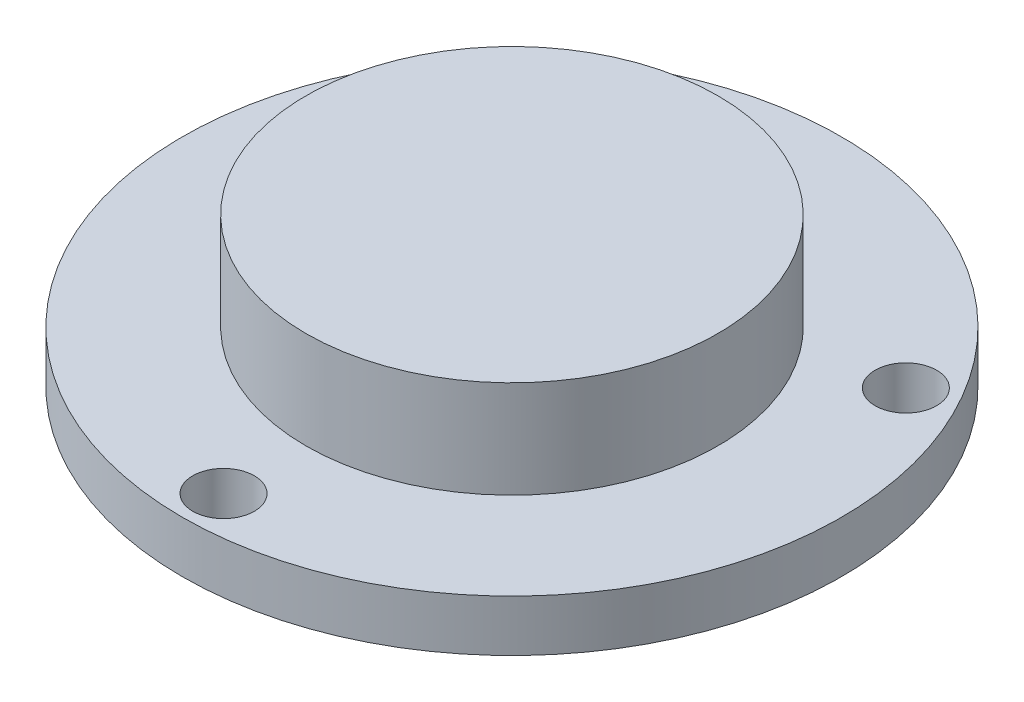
ISO-10303-21;
HEADER;
FILE_DESCRIPTION(('STEP AP214'),'2;1');
FILE_NAME('part.step','',(''),(''),'','','');
FILE_SCHEMA(('AUTOMOTIVE_DESIGN { 1 0 10303 214 1 1 1 1 }'));
ENDSEC;
DATA;
#1=APPLICATION_CONTEXT('core data for automotive mechanical design processes');
#2=APPLICATION_PROTOCOL_DEFINITION('international standard','automotive_design',2000,#1);
#3=PRODUCT_CONTEXT('',#1,'mechanical');
#4=PRODUCT('Part','Part','',(#3));
#5=PRODUCT_RELATED_PRODUCT_CATEGORY('part','',(#4));
#6=PRODUCT_DEFINITION_FORMATION('','',#4);
#7=PRODUCT_DEFINITION_CONTEXT('part definition',#1,'design');
#8=PRODUCT_DEFINITION('design','',#6,#7);
#9=PRODUCT_DEFINITION_SHAPE('','',#8);
#10=(LENGTH_UNIT() NAMED_UNIT(*) SI_UNIT(.MILLI.,.METRE.));
#11=(NAMED_UNIT(*) PLANE_ANGLE_UNIT() SI_UNIT($,.RADIAN.));
#12=(NAMED_UNIT(*) SI_UNIT($,.STERADIAN.) SOLID_ANGLE_UNIT());
#13=UNCERTAINTY_MEASURE_WITH_UNIT(LENGTH_MEASURE(1.E-05),#10,'distance_accuracy_value','');
#14=(GEOMETRIC_REPRESENTATION_CONTEXT(3) GLOBAL_UNCERTAINTY_ASSIGNED_CONTEXT((#13)) GLOBAL_UNIT_ASSIGNED_CONTEXT((#10,
#11,#12)) REPRESENTATION_CONTEXT('',''));
#15=CARTESIAN_POINT('',(0.,0.,0.));
#16=DIRECTION('',(0.,0.,1.));
#17=DIRECTION('',(1.,0.,0.));
#18=AXIS2_PLACEMENT_3D('',#15,#16,#17);
#19=CARTESIAN_POINT('',(0.,3.175,0.));
#20=DIRECTION('',(0.,1.,0.));
#21=DIRECTION('',(0.,0.,1.));
#22=AXIS2_PLACEMENT_3D('',#19,#20,#21);
#23=PLANE('',#22);
#24=CARTESIAN_POINT('',(15.3979316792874,3.175,-8.88999999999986));
#25=DIRECTION('',(0.,1.,0.));
#26=DIRECTION('',(0.,0.,1.));
#27=AXIS2_PLACEMENT_3D('',#24,#25,#26);
#28=CIRCLE('',#27,1.89864999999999);
#29=CARTESIAN_POINT('',(15.3979316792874,3.175,-6.99134999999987));
#30=VERTEX_POINT('',#29);
#31=EDGE_CURVE('E66',#30,#30,#28,.T.);
#32=ORIENTED_EDGE('',*,*,#31,.F.);
#33=EDGE_LOOP('',(#32));
#34=FACE_BOUND('',#33,.T.);
#35=CARTESIAN_POINT('',(-15.3979316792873,3.175,-8.89000000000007));
#36=DIRECTION('',(0.,1.,0.));
#37=DIRECTION('',(0.,0.,1.));
#38=AXIS2_PLACEMENT_3D('',#35,#36,#37);
#39=CIRCLE('',#38,1.89864999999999);
#40=CARTESIAN_POINT('',(-15.3979316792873,3.175,-6.99135000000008));
#41=VERTEX_POINT('',#40);
#42=EDGE_CURVE('E60',#41,#41,#39,.T.);
#43=ORIENTED_EDGE('',*,*,#42,.F.);
#44=EDGE_LOOP('',(#43));
#45=FACE_BOUND('',#44,.T.);
#46=CARTESIAN_POINT('',(0.,3.175,17.78));
#47=DIRECTION('',(0.,1.,0.));
#48=DIRECTION('',(0.,0.,1.));
#49=AXIS2_PLACEMENT_3D('',#46,#47,#48);
#50=CIRCLE('',#49,1.89864999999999);
#51=CARTESIAN_POINT('',(0.,3.175,19.67865));
#52=VERTEX_POINT('',#51);
#53=EDGE_CURVE('E54',#52,#52,#50,.T.);
#54=ORIENTED_EDGE('',*,*,#53,.F.);
#55=EDGE_LOOP('',(#54));
#56=FACE_BOUND('',#55,.T.);
#57=CARTESIAN_POINT('',(0.,3.175,0.));
#58=DIRECTION('',(0.,1.,0.));
#59=DIRECTION('',(0.,0.,1.));
#60=AXIS2_PLACEMENT_3D('',#57,#58,#59);
#61=CIRCLE('',#60,20.32);
#62=CARTESIAN_POINT('',(0.,3.175,20.32));
#63=VERTEX_POINT('',#62);
#64=EDGE_CURVE('E10',#63,#63,#61,.T.);
#65=ORIENTED_EDGE('',*,*,#64,.T.);
#66=EDGE_LOOP('',(#65));
#67=FACE_BOUND('',#66,.T.);
#68=CARTESIAN_POINT('',(0.,3.175,0.));
#69=DIRECTION('',(0.,1.,0.));
#70=DIRECTION('',(0.,0.,1.));
#71=AXIS2_PLACEMENT_3D('',#68,#69,#70);
#72=CIRCLE('',#71,12.7);
#73=CARTESIAN_POINT('',(0.,3.175,12.7));
#74=VERTEX_POINT('',#73);
#75=EDGE_CURVE('E46',#74,#74,#72,.T.);
#76=ORIENTED_EDGE('',*,*,#75,.F.);
#77=EDGE_LOOP('',(#76));
#78=FACE_BOUND('',#77,.T.);
#79=ADVANCED_FACE('F33',(#34,#45,#56,#67,#78),#23,.T.);
#80=CARTESIAN_POINT('',(0.,3.175,0.));
#81=DIRECTION('',(0.,-1.,0.));
#82=DIRECTION('',(0.,0.,-1.));
#83=AXIS2_PLACEMENT_3D('',#80,#81,#82);
#84=CYLINDRICAL_SURFACE('',#83,20.32);
#85=ORIENTED_EDGE('',*,*,#64,.F.);
#86=EDGE_LOOP('',(#85));
#87=FACE_BOUND('',#86,.T.);
#88=CARTESIAN_POINT('',(0.,0.,0.));
#89=DIRECTION('',(0.,1.,0.));
#90=DIRECTION('',(0.,0.,1.));
#91=AXIS2_PLACEMENT_3D('',#88,#89,#90);
#92=CIRCLE('',#91,20.32);
#93=CARTESIAN_POINT('',(0.,0.,20.32));
#94=VERTEX_POINT('',#93);
#95=EDGE_CURVE('E37',#94,#94,#92,.T.);
#96=ORIENTED_EDGE('',*,*,#95,.T.);
#97=EDGE_LOOP('',(#96));
#98=FACE_BOUND('',#97,.T.);
#99=ADVANCED_FACE('F35',(#87,#98),#84,.T.);
#100=CARTESIAN_POINT('',(0.,0.,0.));
#101=DIRECTION('',(0.,1.,0.));
#102=DIRECTION('',(0.,0.,1.));
#103=AXIS2_PLACEMENT_3D('',#100,#101,#102);
#104=PLANE('',#103);
#105=CARTESIAN_POINT('',(15.3979316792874,0.,-8.88999999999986));
#106=DIRECTION('',(0.,1.,0.));
#107=DIRECTION('',(0.,0.,1.));
#108=AXIS2_PLACEMENT_3D('',#105,#106,#107);
#109=CIRCLE('',#108,1.89865);
#110=CARTESIAN_POINT('',(15.3979316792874,0.,-6.99134999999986));
#111=VERTEX_POINT('',#110);
#112=EDGE_CURVE('E63',#111,#111,#109,.T.);
#113=ORIENTED_EDGE('',*,*,#112,.T.);
#114=EDGE_LOOP('',(#113));
#115=FACE_BOUND('',#114,.T.);
#116=CARTESIAN_POINT('',(-15.3979316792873,0.,-8.89000000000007));
#117=DIRECTION('',(0.,1.,0.));
#118=DIRECTION('',(0.,0.,1.));
#119=AXIS2_PLACEMENT_3D('',#116,#117,#118);
#120=CIRCLE('',#119,1.89865);
#121=CARTESIAN_POINT('',(-15.3979316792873,0.,-6.99135000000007));
#122=VERTEX_POINT('',#121);
#123=EDGE_CURVE('E57',#122,#122,#120,.T.);
#124=ORIENTED_EDGE('',*,*,#123,.T.);
#125=EDGE_LOOP('',(#124));
#126=FACE_BOUND('',#125,.T.);
#127=CARTESIAN_POINT('',(0.,0.,17.78));
#128=DIRECTION('',(0.,1.,0.));
#129=DIRECTION('',(0.,0.,1.));
#130=AXIS2_PLACEMENT_3D('',#127,#128,#129);
#131=CIRCLE('',#130,1.89865);
#132=CARTESIAN_POINT('',(0.,0.,19.67865));
#133=VERTEX_POINT('',#132);
#134=EDGE_CURVE('E49',#133,#133,#131,.T.);
#135=ORIENTED_EDGE('',*,*,#134,.T.);
#136=EDGE_LOOP('',(#135));
#137=FACE_BOUND('',#136,.T.);
#138=ORIENTED_EDGE('',*,*,#95,.F.);
#139=EDGE_LOOP('',(#138));
#140=FACE_BOUND('',#139,.T.);
#141=ADVANCED_FACE('F84',(#115,#126,#137,#140),#104,.F.);
#142=CARTESIAN_POINT('',(0.,9.175,0.));
#143=DIRECTION('',(0.,-1.,0.));
#144=DIRECTION('',(0.,0.,-1.));
#145=AXIS2_PLACEMENT_3D('',#142,#143,#144);
#146=CYLINDRICAL_SURFACE('',#145,12.7);
#147=CARTESIAN_POINT('',(0.,9.175,0.));
#148=DIRECTION('',(0.,1.,0.));
#149=DIRECTION('',(0.,0.,1.));
#150=AXIS2_PLACEMENT_3D('',#147,#148,#149);
#151=CIRCLE('',#150,12.7);
#152=CARTESIAN_POINT('',(0.,9.175,12.7));
#153=VERTEX_POINT('',#152);
#154=EDGE_CURVE('E44',#153,#153,#151,.T.);
#155=ORIENTED_EDGE('',*,*,#154,.F.);
#156=EDGE_LOOP('',(#155));
#157=FACE_BOUND('',#156,.T.);
#158=ORIENTED_EDGE('',*,*,#75,.T.);
#159=EDGE_LOOP('',(#158));
#160=FACE_BOUND('',#159,.T.);
#161=ADVANCED_FACE('F81',(#157,#160),#146,.T.);
#162=CARTESIAN_POINT('',(0.,9.175,0.));
#163=DIRECTION('',(0.,1.,0.));
#164=DIRECTION('',(0.,0.,1.));
#165=AXIS2_PLACEMENT_3D('',#162,#163,#164);
#166=PLANE('',#165);
#167=ORIENTED_EDGE('',*,*,#154,.T.);
#168=EDGE_LOOP('',(#167));
#169=FACE_BOUND('',#168,.T.);
#170=ADVANCED_FACE('F83',(#169),#166,.T.);
#171=CARTESIAN_POINT('',(0.,3.175,17.78));
#172=DIRECTION('',(0.,1.,0.));
#173=DIRECTION('',(0.,0.,1.));
#174=AXIS2_PLACEMENT_3D('',#171,#172,#173);
#175=CYLINDRICAL_SURFACE('',#174,1.89864999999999);
#176=ORIENTED_EDGE('',*,*,#134,.F.);
#177=EDGE_LOOP('',(#176));
#178=FACE_BOUND('',#177,.T.);
#179=ORIENTED_EDGE('',*,*,#53,.T.);
#180=EDGE_LOOP('',(#179));
#181=FACE_BOUND('',#180,.T.);
#182=ADVANCED_FACE('F91',(#178,#181),#175,.F.);
#183=CARTESIAN_POINT('',(-15.3979316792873,3.175,-8.89000000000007));
#184=DIRECTION('',(0.,1.,0.));
#185=DIRECTION('',(0.,0.,1.));
#186=AXIS2_PLACEMENT_3D('',#183,#184,#185);
#187=CYLINDRICAL_SURFACE('',#186,1.89864999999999);
#188=ORIENTED_EDGE('',*,*,#123,.F.);
#189=EDGE_LOOP('',(#188));
#190=FACE_BOUND('',#189,.T.);
#191=ORIENTED_EDGE('',*,*,#42,.T.);
#192=EDGE_LOOP('',(#191));
#193=FACE_BOUND('',#192,.T.);
#194=ADVANCED_FACE('F99',(#190,#193),#187,.F.);
#195=CARTESIAN_POINT('',(15.3979316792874,3.175,-8.88999999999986));
#196=DIRECTION('',(0.,1.,0.));
#197=DIRECTION('',(0.,0.,1.));
#198=AXIS2_PLACEMENT_3D('',#195,#196,#197);
#199=CYLINDRICAL_SURFACE('',#198,1.89864999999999);
#200=ORIENTED_EDGE('',*,*,#112,.F.);
#201=EDGE_LOOP('',(#200));
#202=FACE_BOUND('',#201,.T.);
#203=ORIENTED_EDGE('',*,*,#31,.T.);
#204=EDGE_LOOP('',(#203));
#205=FACE_BOUND('',#204,.T.);
#206=ADVANCED_FACE('F70',(#202,#205),#199,.F.);
#207=CLOSED_SHELL('',(#79,#99,#141,#161,#170,#182,#194,#206));
#208=MANIFOLD_SOLID_BREP('B2',#207);
#209=ADVANCED_BREP_SHAPE_REPRESENTATION('',(#18,#208),#14);
#210=SHAPE_DEFINITION_REPRESENTATION(#9,#209);
ENDSEC;
END-ISO-10303-21;
